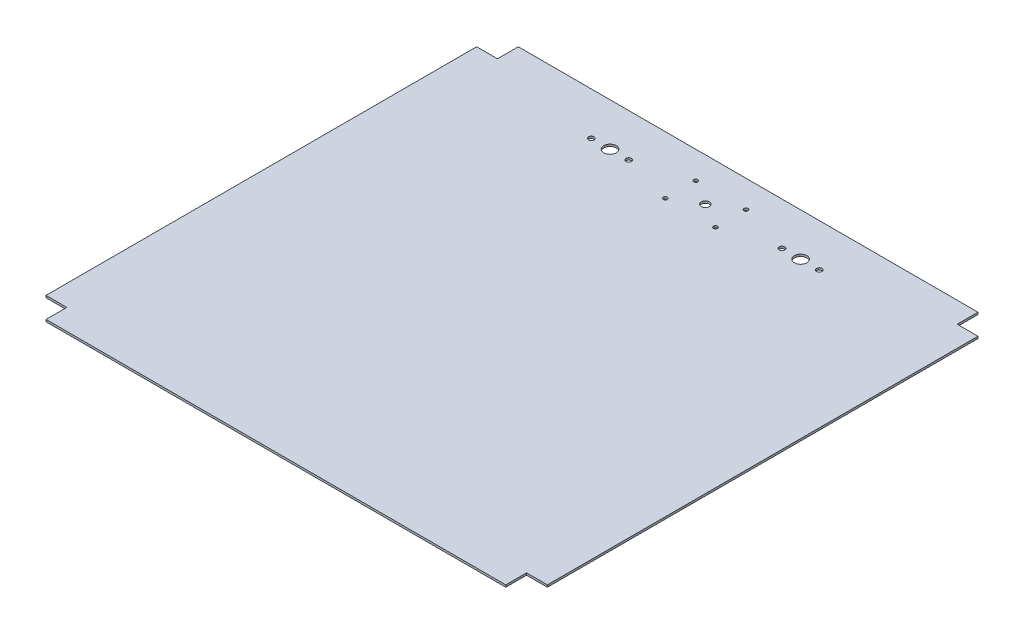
ISO-10303-21;
HEADER;
FILE_DESCRIPTION(('STEP AP214'),'2;1');
FILE_NAME('part.step','',(''),(''),'','','');
FILE_SCHEMA(('AUTOMOTIVE_DESIGN { 1 0 10303 214 1 1 1 1 }'));
ENDSEC;
DATA;
#1=APPLICATION_CONTEXT('core data for automotive mechanical design processes');
#2=APPLICATION_PROTOCOL_DEFINITION('international standard','automotive_design',2000,#1);
#3=PRODUCT_CONTEXT('',#1,'mechanical');
#4=PRODUCT('Part','Part','',(#3));
#5=PRODUCT_RELATED_PRODUCT_CATEGORY('part','',(#4));
#6=PRODUCT_DEFINITION_FORMATION('','',#4);
#7=PRODUCT_DEFINITION_CONTEXT('part definition',#1,'design');
#8=PRODUCT_DEFINITION('design','',#6,#7);
#9=PRODUCT_DEFINITION_SHAPE('','',#8);
#10=(LENGTH_UNIT() NAMED_UNIT(*) SI_UNIT(.MILLI.,.METRE.));
#11=(NAMED_UNIT(*) PLANE_ANGLE_UNIT() SI_UNIT($,.RADIAN.));
#12=(NAMED_UNIT(*) SI_UNIT($,.STERADIAN.) SOLID_ANGLE_UNIT());
#13=UNCERTAINTY_MEASURE_WITH_UNIT(LENGTH_MEASURE(1.E-05),#10,'distance_accuracy_value','');
#14=(GEOMETRIC_REPRESENTATION_CONTEXT(3) GLOBAL_UNCERTAINTY_ASSIGNED_CONTEXT((#13)) GLOBAL_UNIT_ASSIGNED_CONTEXT((#10,
#11,#12)) REPRESENTATION_CONTEXT('',''));
#15=CARTESIAN_POINT('',(0.,0.,0.));
#16=DIRECTION('',(0.,0.,1.));
#17=DIRECTION('',(1.,0.,0.));
#18=AXIS2_PLACEMENT_3D('',#15,#16,#17);
#19=CARTESIAN_POINT('',(241.,2.,-227.));
#20=DIRECTION('',(-1.,0.,0.));
#21=DIRECTION('',(0.,0.,1.));
#22=AXIS2_PLACEMENT_3D('',#19,#20,#21);
#23=PLANE('',#22);
#24=DIRECTION('',(0.,0.,-1.));
#25=VECTOR('',#24,1.);
#26=CARTESIAN_POINT('',(241.,2.,-227.));
#27=LINE('',#26,#25);
#28=CARTESIAN_POINT('',(241.,2.,207.));
#29=VERTEX_POINT('',#28);
#30=CARTESIAN_POINT('',(241.,2.,-207.));
#31=VERTEX_POINT('',#30);
#32=EDGE_CURVE('E175',#29,#31,#27,.T.);
#33=ORIENTED_EDGE('',*,*,#32,.F.);
#34=DIRECTION('',(0.,1.,0.));
#35=VECTOR('',#34,1.);
#36=CARTESIAN_POINT('',(241.,0.,207.));
#37=LINE('',#36,#35);
#38=CARTESIAN_POINT('',(241.,0.,207.));
#39=VERTEX_POINT('',#38);
#40=EDGE_CURVE('E224',#39,#29,#37,.T.);
#41=ORIENTED_EDGE('',*,*,#40,.F.);
#42=DIRECTION('',(0.,0.,-1.));
#43=VECTOR('',#42,1.);
#44=CARTESIAN_POINT('',(241.,0.,-227.));
#45=LINE('',#44,#43);
#46=CARTESIAN_POINT('',(241.,0.,-207.));
#47=VERTEX_POINT('',#46);
#48=EDGE_CURVE('E161',#39,#47,#45,.T.);
#49=ORIENTED_EDGE('',*,*,#48,.T.);
#50=DIRECTION('',(0.,1.,0.));
#51=VECTOR('',#50,1.);
#52=CARTESIAN_POINT('',(241.,0.,-207.));
#53=LINE('',#52,#51);
#54=EDGE_CURVE('E195',#47,#31,#53,.T.);
#55=ORIENTED_EDGE('',*,*,#54,.T.);
#56=EDGE_LOOP('',(#33,#41,#49,#55));
#57=FACE_BOUND('',#56,.T.);
#58=ADVANCED_FACE('F39',(#57),#23,.F.);
#59=CARTESIAN_POINT('',(-241.,2.,-227.));
#60=DIRECTION('',(0.,0.,1.));
#61=DIRECTION('',(1.,0.,0.));
#62=AXIS2_PLACEMENT_3D('',#59,#60,#61);
#63=PLANE('',#62);
#64=DIRECTION('',(-1.,0.,0.));
#65=VECTOR('',#64,1.);
#66=CARTESIAN_POINT('',(-241.,2.,-227.));
#67=LINE('',#66,#65);
#68=CARTESIAN_POINT('',(221.,2.,-227.));
#69=VERTEX_POINT('',#68);
#70=CARTESIAN_POINT('',(-221.,2.,-227.));
#71=VERTEX_POINT('',#70);
#72=EDGE_CURVE('E151',#69,#71,#67,.T.);
#73=ORIENTED_EDGE('',*,*,#72,.F.);
#74=DIRECTION('',(0.,1.,0.));
#75=VECTOR('',#74,1.);
#76=CARTESIAN_POINT('',(221.,0.,-227.));
#77=LINE('',#76,#75);
#78=CARTESIAN_POINT('',(221.,0.,-227.));
#79=VERTEX_POINT('',#78);
#80=EDGE_CURVE('E134',#79,#69,#77,.T.);
#81=ORIENTED_EDGE('',*,*,#80,.F.);
#82=DIRECTION('',(-1.,0.,0.));
#83=VECTOR('',#82,1.);
#84=CARTESIAN_POINT('',(-241.,0.,-227.));
#85=LINE('',#84,#83);
#86=CARTESIAN_POINT('',(-221.,0.,-227.));
#87=VERTEX_POINT('',#86);
#88=EDGE_CURVE('E149',#79,#87,#85,.T.);
#89=ORIENTED_EDGE('',*,*,#88,.T.);
#90=DIRECTION('',(0.,1.,0.));
#91=VECTOR('',#90,1.);
#92=CARTESIAN_POINT('',(-221.,0.,-227.));
#93=LINE('',#92,#91);
#94=EDGE_CURVE('E167',#87,#71,#93,.T.);
#95=ORIENTED_EDGE('',*,*,#94,.T.);
#96=EDGE_LOOP('',(#73,#81,#89,#95));
#97=FACE_BOUND('',#96,.T.);
#98=ADVANCED_FACE('F147',(#97),#63,.F.);
#99=CARTESIAN_POINT('',(-241.,2.,-227.));
#100=DIRECTION('',(1.,0.,0.));
#101=DIRECTION('',(0.,0.,-1.));
#102=AXIS2_PLACEMENT_3D('',#99,#100,#101);
#103=PLANE('',#102);
#104=DIRECTION('',(0.,0.,1.));
#105=VECTOR('',#104,1.);
#106=CARTESIAN_POINT('',(-241.,0.,-227.));
#107=LINE('',#106,#105);
#108=CARTESIAN_POINT('',(-241.,0.,-207.));
#109=VERTEX_POINT('',#108);
#110=CARTESIAN_POINT('',(-241.,0.,207.));
#111=VERTEX_POINT('',#110);
#112=EDGE_CURVE('E160',#109,#111,#107,.T.);
#113=ORIENTED_EDGE('',*,*,#112,.T.);
#114=DIRECTION('',(0.,1.,0.));
#115=VECTOR('',#114,1.);
#116=CARTESIAN_POINT('',(-241.,0.,207.));
#117=LINE('',#116,#115);
#118=CARTESIAN_POINT('',(-241.,2.,207.));
#119=VERTEX_POINT('',#118);
#120=EDGE_CURVE('E206',#111,#119,#117,.T.);
#121=ORIENTED_EDGE('',*,*,#120,.T.);
#122=DIRECTION('',(0.,0.,1.));
#123=VECTOR('',#122,1.);
#124=CARTESIAN_POINT('',(-241.,2.,-227.));
#125=LINE('',#124,#123);
#126=CARTESIAN_POINT('',(-241.,2.,-207.));
#127=VERTEX_POINT('',#126);
#128=EDGE_CURVE('E48',#127,#119,#125,.T.);
#129=ORIENTED_EDGE('',*,*,#128,.F.);
#130=DIRECTION('',(0.,1.,0.));
#131=VECTOR('',#130,1.);
#132=CARTESIAN_POINT('',(-241.,0.,-207.));
#133=LINE('',#132,#131);
#134=EDGE_CURVE('E179',#109,#127,#133,.T.);
#135=ORIENTED_EDGE('',*,*,#134,.F.);
#136=EDGE_LOOP('',(#113,#121,#129,#135));
#137=FACE_BOUND('',#136,.T.);
#138=ADVANCED_FACE('F373',(#137),#103,.F.);
#139=CARTESIAN_POINT('',(-241.,2.,227.));
#140=DIRECTION('',(0.,0.,-1.));
#141=DIRECTION('',(-1.,0.,0.));
#142=AXIS2_PLACEMENT_3D('',#139,#140,#141);
#143=PLANE('',#142);
#144=DIRECTION('',(1.,0.,0.));
#145=VECTOR('',#144,1.);
#146=CARTESIAN_POINT('',(-241.,2.,227.));
#147=LINE('',#146,#145);
#148=CARTESIAN_POINT('',(-221.,2.,227.));
#149=VERTEX_POINT('',#148);
#150=CARTESIAN_POINT('',(221.,2.,227.));
#151=VERTEX_POINT('',#150);
#152=EDGE_CURVE('E11',#149,#151,#147,.T.);
#153=ORIENTED_EDGE('',*,*,#152,.F.);
#154=DIRECTION('',(0.,1.,0.));
#155=VECTOR('',#154,1.);
#156=CARTESIAN_POINT('',(-221.,0.,227.));
#157=LINE('',#156,#155);
#158=CARTESIAN_POINT('',(-221.,0.,227.));
#159=VERTEX_POINT('',#158);
#160=EDGE_CURVE('E200',#159,#149,#157,.T.);
#161=ORIENTED_EDGE('',*,*,#160,.F.);
#162=DIRECTION('',(1.,0.,0.));
#163=VECTOR('',#162,1.);
#164=CARTESIAN_POINT('',(-241.,0.,227.));
#165=LINE('',#164,#163);
#166=CARTESIAN_POINT('',(221.,0.,227.));
#167=VERTEX_POINT('',#166);
#168=EDGE_CURVE('E42',#159,#167,#165,.T.);
#169=ORIENTED_EDGE('',*,*,#168,.T.);
#170=DIRECTION('',(0.,1.,0.));
#171=VECTOR('',#170,1.);
#172=CARTESIAN_POINT('',(221.,0.,227.));
#173=LINE('',#172,#171);
#174=EDGE_CURVE('E230',#167,#151,#173,.T.);
#175=ORIENTED_EDGE('',*,*,#174,.T.);
#176=EDGE_LOOP('',(#153,#161,#169,#175));
#177=FACE_BOUND('',#176,.T.);
#178=ADVANCED_FACE('F359',(#177),#143,.F.);
#179=CARTESIAN_POINT('',(0.,2.,0.));
#180=DIRECTION('',(0.,1.,0.));
#181=DIRECTION('',(0.,0.,1.));
#182=AXIS2_PLACEMENT_3D('',#179,#180,#181);
#183=PLANE('',#182);
#184=CARTESIAN_POINT('',(24.1,2.,-200.85));
#185=DIRECTION('',(0.,1.,0.));
#186=DIRECTION('',(0.,0.,1.));
#187=AXIS2_PLACEMENT_3D('',#184,#185,#186);
#188=CIRCLE('',#187,1.95);
#189=CARTESIAN_POINT('',(24.1,2.,-198.9));
#190=VERTEX_POINT('',#189);
#191=EDGE_CURVE('E307',#190,#190,#188,.T.);
#192=ORIENTED_EDGE('',*,*,#191,.F.);
#193=EDGE_LOOP('',(#192));
#194=FACE_BOUND('',#193,.T.);
#195=CARTESIAN_POINT('',(24.1,2.,-171.55));
#196=DIRECTION('',(0.,1.,0.));
#197=DIRECTION('',(0.,0.,1.));
#198=AXIS2_PLACEMENT_3D('',#195,#196,#197);
#199=CIRCLE('',#198,1.95);
#200=CARTESIAN_POINT('',(24.1,2.,-169.6));
#201=VERTEX_POINT('',#200);
#202=EDGE_CURVE('E298',#201,#201,#199,.T.);
#203=ORIENTED_EDGE('',*,*,#202,.F.);
#204=EDGE_LOOP('',(#203));
#205=FACE_BOUND('',#204,.T.);
#206=CARTESIAN_POINT('',(-109.55,2.,-185.85));
#207=DIRECTION('',(0.,1.,0.));
#208=DIRECTION('',(0.,0.,1.));
#209=AXIS2_PLACEMENT_3D('',#206,#207,#208);
#210=CIRCLE('',#209,2.65000000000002);
#211=CARTESIAN_POINT('',(-109.55,2.,-183.2));
#212=VERTEX_POINT('',#211);
#213=EDGE_CURVE('E323',#212,#212,#210,.T.);
#214=ORIENTED_EDGE('',*,*,#213,.F.);
#215=EDGE_LOOP('',(#214));
#216=FACE_BOUND('',#215,.T.);
#217=CARTESIAN_POINT('',(91.6,2.,-185.85));
#218=DIRECTION('',(0.,1.,0.));
#219=DIRECTION('',(0.,0.,-1.));
#220=AXIS2_PLACEMENT_3D('',#217,#218,#219);
#221=CIRCLE('',#220,6.);
#222=CARTESIAN_POINT('',(91.6,2.,-191.85));
#223=VERTEX_POINT('',#222);
#224=EDGE_CURVE('E314',#223,#223,#221,.T.);
#225=ORIENTED_EDGE('',*,*,#224,.F.);
#226=EDGE_LOOP('',(#225));
#227=FACE_BOUND('',#226,.T.);
#228=CARTESIAN_POINT('',(-73.65,2.,-185.85));
#229=DIRECTION('',(0.,1.,0.));
#230=DIRECTION('',(0.,0.,1.));
#231=AXIS2_PLACEMENT_3D('',#228,#229,#230);
#232=CIRCLE('',#231,2.65);
#233=CARTESIAN_POINT('',(-73.65,2.,-183.2));
#234=VERTEX_POINT('',#233);
#235=EDGE_CURVE('E275',#234,#234,#232,.T.);
#236=ORIENTED_EDGE('',*,*,#235,.F.);
#237=EDGE_LOOP('',(#236));
#238=FACE_BOUND('',#237,.T.);
#239=CARTESIAN_POINT('',(0.,2.,-185.85));
#240=DIRECTION('',(0.,1.,0.));
#241=DIRECTION('',(0.,0.,1.));
#242=AXIS2_PLACEMENT_3D('',#239,#240,#241);
#243=CIRCLE('',#242,3.89999999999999);
#244=CARTESIAN_POINT('',(0.,2.,-181.95));
#245=VERTEX_POINT('',#244);
#246=EDGE_CURVE('E266',#245,#245,#243,.T.);
#247=ORIENTED_EDGE('',*,*,#246,.F.);
#248=EDGE_LOOP('',(#247));
#249=FACE_BOUND('',#248,.T.);
#250=CARTESIAN_POINT('',(-24.1,2.,-200.85));
#251=DIRECTION('',(0.,1.,0.));
#252=DIRECTION('',(0.,0.,1.));
#253=AXIS2_PLACEMENT_3D('',#250,#251,#252);
#254=CIRCLE('',#253,1.95);
#255=CARTESIAN_POINT('',(-24.1,2.,-198.9));
#256=VERTEX_POINT('',#255);
#257=EDGE_CURVE('E291',#256,#256,#254,.T.);
#258=ORIENTED_EDGE('',*,*,#257,.F.);
#259=EDGE_LOOP('',(#258));
#260=FACE_BOUND('',#259,.T.);
#261=CARTESIAN_POINT('',(-24.1,2.,-171.55));
#262=DIRECTION('',(0.,1.,0.));
#263=DIRECTION('',(0.,0.,1.));
#264=AXIS2_PLACEMENT_3D('',#261,#262,#263);
#265=CIRCLE('',#264,1.95);
#266=CARTESIAN_POINT('',(-24.1,2.,-169.6));
#267=VERTEX_POINT('',#266);
#268=EDGE_CURVE('E282',#267,#267,#265,.T.);
#269=ORIENTED_EDGE('',*,*,#268,.F.);
#270=EDGE_LOOP('',(#269));
#271=FACE_BOUND('',#270,.T.);
#272=CARTESIAN_POINT('',(109.55,2.,-185.85));
#273=DIRECTION('',(0.,1.,0.));
#274=DIRECTION('',(0.,0.,-1.));
#275=AXIS2_PLACEMENT_3D('',#272,#273,#274);
#276=CIRCLE('',#275,2.65000000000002);
#277=CARTESIAN_POINT('',(109.55,2.,-188.5));
#278=VERTEX_POINT('',#277);
#279=EDGE_CURVE('E338',#278,#278,#276,.T.);
#280=ORIENTED_EDGE('',*,*,#279,.F.);
#281=EDGE_LOOP('',(#280));
#282=FACE_BOUND('',#281,.T.);
#283=CARTESIAN_POINT('',(73.65,2.,-185.85));
#284=DIRECTION('',(0.,1.,0.));
#285=DIRECTION('',(0.,0.,-1.));
#286=AXIS2_PLACEMENT_3D('',#283,#284,#285);
#287=CIRCLE('',#286,2.65);
#288=CARTESIAN_POINT('',(73.65,2.,-188.5));
#289=VERTEX_POINT('',#288);
#290=EDGE_CURVE('E330',#289,#289,#287,.T.);
#291=ORIENTED_EDGE('',*,*,#290,.F.);
#292=EDGE_LOOP('',(#291));
#293=FACE_BOUND('',#292,.T.);
#294=CARTESIAN_POINT('',(-91.6,2.,-185.85));
#295=DIRECTION('',(0.,1.,0.));
#296=DIRECTION('',(0.,0.,1.));
#297=AXIS2_PLACEMENT_3D('',#294,#295,#296);
#298=CIRCLE('',#297,6.);
#299=CARTESIAN_POINT('',(-91.6,2.,-179.85));
#300=VERTEX_POINT('',#299);
#301=EDGE_CURVE('E258',#300,#300,#298,.T.);
#302=ORIENTED_EDGE('',*,*,#301,.F.);
#303=EDGE_LOOP('',(#302));
#304=FACE_BOUND('',#303,.T.);
#305=DIRECTION('',(-1.,0.,0.));
#306=VECTOR('',#305,1.);
#307=CARTESIAN_POINT('',(-241.,2.,207.));
#308=LINE('',#307,#306);
#309=CARTESIAN_POINT('',(-221.,2.,207.));
#310=VERTEX_POINT('',#309);
#311=EDGE_CURVE('E211',#310,#119,#308,.T.);
#312=ORIENTED_EDGE('',*,*,#311,.F.);
#313=DIRECTION('',(0.,0.,-1.));
#314=VECTOR('',#313,1.);
#315=CARTESIAN_POINT('',(-221.,2.,227.));
#316=LINE('',#315,#314);
#317=EDGE_CURVE('E215',#149,#310,#316,.T.);
#318=ORIENTED_EDGE('',*,*,#317,.F.);
#319=ORIENTED_EDGE('',*,*,#152,.T.);
#320=DIRECTION('',(0.,0.,1.));
#321=VECTOR('',#320,1.);
#322=CARTESIAN_POINT('',(221.,2.,227.));
#323=LINE('',#322,#321);
#324=CARTESIAN_POINT('',(221.,2.,207.));
#325=VERTEX_POINT('',#324);
#326=EDGE_CURVE('E235',#325,#151,#323,.T.);
#327=ORIENTED_EDGE('',*,*,#326,.F.);
#328=DIRECTION('',(-1.,0.,0.));
#329=VECTOR('',#328,1.);
#330=CARTESIAN_POINT('',(241.,2.,207.));
#331=LINE('',#330,#329);
#332=EDGE_CURVE('E210',#29,#325,#331,.T.);
#333=ORIENTED_EDGE('',*,*,#332,.F.);
#334=ORIENTED_EDGE('',*,*,#32,.T.);
#335=DIRECTION('',(1.,0.,0.));
#336=VECTOR('',#335,1.);
#337=CARTESIAN_POINT('',(241.,2.,-207.));
#338=LINE('',#337,#336);
#339=CARTESIAN_POINT('',(221.,2.,-207.));
#340=VERTEX_POINT('',#339);
#341=EDGE_CURVE('E142',#340,#31,#338,.T.);
#342=ORIENTED_EDGE('',*,*,#341,.F.);
#343=DIRECTION('',(0.,0.,1.));
#344=VECTOR('',#343,1.);
#345=CARTESIAN_POINT('',(221.,2.,-227.));
#346=LINE('',#345,#344);
#347=EDGE_CURVE('E234',#69,#340,#346,.T.);
#348=ORIENTED_EDGE('',*,*,#347,.F.);
#349=ORIENTED_EDGE('',*,*,#72,.T.);
#350=DIRECTION('',(0.,0.,-1.));
#351=VECTOR('',#350,1.);
#352=CARTESIAN_POINT('',(-221.,2.,-227.));
#353=LINE('',#352,#351);
#354=CARTESIAN_POINT('',(-221.,2.,-207.));
#355=VERTEX_POINT('',#354);
#356=EDGE_CURVE('E187',#355,#71,#353,.T.);
#357=ORIENTED_EDGE('',*,*,#356,.F.);
#358=DIRECTION('',(1.,0.,0.));
#359=VECTOR('',#358,1.);
#360=CARTESIAN_POINT('',(-241.,2.,-207.));
#361=LINE('',#360,#359);
#362=EDGE_CURVE('E191',#127,#355,#361,.T.);
#363=ORIENTED_EDGE('',*,*,#362,.F.);
#364=ORIENTED_EDGE('',*,*,#128,.T.);
#365=EDGE_LOOP('',(#312,#318,#319,#327,#333,#334,#342,#348,#349,#357,#363,#364));
#366=FACE_BOUND('',#365,.T.);
#367=ADVANCED_FACE('F356',(#194,#205,#216,#227,#238,#249,#260,#271,#282,#293,#304,#366),#183,.T.);
#368=CARTESIAN_POINT('',(0.,0.,0.));
#369=DIRECTION('',(0.,1.,0.));
#370=DIRECTION('',(0.,0.,1.));
#371=AXIS2_PLACEMENT_3D('',#368,#369,#370);
#372=PLANE('',#371);
#373=CARTESIAN_POINT('',(24.1,0.,-200.85));
#374=DIRECTION('',(0.,1.,0.));
#375=DIRECTION('',(0.,0.,1.));
#376=AXIS2_PLACEMENT_3D('',#373,#374,#375);
#377=CIRCLE('',#376,1.95);
#378=CARTESIAN_POINT('',(24.1,0.,-198.9));
#379=VERTEX_POINT('',#378);
#380=EDGE_CURVE('E287',#379,#379,#377,.T.);
#381=ORIENTED_EDGE('',*,*,#380,.T.);
#382=EDGE_LOOP('',(#381));
#383=FACE_BOUND('',#382,.T.);
#384=CARTESIAN_POINT('',(24.1,0.,-171.55));
#385=DIRECTION('',(0.,1.,0.));
#386=DIRECTION('',(0.,0.,1.));
#387=AXIS2_PLACEMENT_3D('',#384,#385,#386);
#388=CIRCLE('',#387,1.95);
#389=CARTESIAN_POINT('',(24.1,0.,-169.6));
#390=VERTEX_POINT('',#389);
#391=EDGE_CURVE('E302',#390,#390,#388,.T.);
#392=ORIENTED_EDGE('',*,*,#391,.T.);
#393=EDGE_LOOP('',(#392));
#394=FACE_BOUND('',#393,.T.);
#395=CARTESIAN_POINT('',(-109.55,0.,-185.85));
#396=DIRECTION('',(0.,1.,0.));
#397=DIRECTION('',(0.,0.,1.));
#398=AXIS2_PLACEMENT_3D('',#395,#396,#397);
#399=CIRCLE('',#398,2.65000000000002);
#400=CARTESIAN_POINT('',(-109.55,0.,-183.2));
#401=VERTEX_POINT('',#400);
#402=EDGE_CURVE('E303',#401,#401,#399,.T.);
#403=ORIENTED_EDGE('',*,*,#402,.T.);
#404=EDGE_LOOP('',(#403));
#405=FACE_BOUND('',#404,.T.);
#406=CARTESIAN_POINT('',(91.6,0.,-185.85));
#407=DIRECTION('',(0.,1.,0.));
#408=DIRECTION('',(0.,0.,-1.));
#409=AXIS2_PLACEMENT_3D('',#406,#407,#408);
#410=CIRCLE('',#409,6.);
#411=CARTESIAN_POINT('',(91.6,0.,-191.85));
#412=VERTEX_POINT('',#411);
#413=EDGE_CURVE('E318',#412,#412,#410,.T.);
#414=ORIENTED_EDGE('',*,*,#413,.T.);
#415=EDGE_LOOP('',(#414));
#416=FACE_BOUND('',#415,.T.);
#417=CARTESIAN_POINT('',(-73.65,0.,-185.85));
#418=DIRECTION('',(0.,1.,0.));
#419=DIRECTION('',(0.,0.,1.));
#420=AXIS2_PLACEMENT_3D('',#417,#418,#419);
#421=CIRCLE('',#420,2.65);
#422=CARTESIAN_POINT('',(-73.65,0.,-183.2));
#423=VERTEX_POINT('',#422);
#424=EDGE_CURVE('E262',#423,#423,#421,.T.);
#425=ORIENTED_EDGE('',*,*,#424,.T.);
#426=EDGE_LOOP('',(#425));
#427=FACE_BOUND('',#426,.T.);
#428=CARTESIAN_POINT('',(0.,0.,-185.85));
#429=DIRECTION('',(0.,1.,0.));
#430=DIRECTION('',(0.,0.,1.));
#431=AXIS2_PLACEMENT_3D('',#428,#429,#430);
#432=CIRCLE('',#431,3.89999999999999);
#433=CARTESIAN_POINT('',(0.,0.,-181.95));
#434=VERTEX_POINT('',#433);
#435=EDGE_CURVE('E270',#434,#434,#432,.T.);
#436=ORIENTED_EDGE('',*,*,#435,.T.);
#437=EDGE_LOOP('',(#436));
#438=FACE_BOUND('',#437,.T.);
#439=CARTESIAN_POINT('',(-24.1,0.,-200.85));
#440=DIRECTION('',(0.,1.,0.));
#441=DIRECTION('',(0.,0.,1.));
#442=AXIS2_PLACEMENT_3D('',#439,#440,#441);
#443=CIRCLE('',#442,1.95);
#444=CARTESIAN_POINT('',(-24.1,0.,-198.9));
#445=VERTEX_POINT('',#444);
#446=EDGE_CURVE('E271',#445,#445,#443,.T.);
#447=ORIENTED_EDGE('',*,*,#446,.T.);
#448=EDGE_LOOP('',(#447));
#449=FACE_BOUND('',#448,.T.);
#450=CARTESIAN_POINT('',(-24.1,0.,-171.55));
#451=DIRECTION('',(0.,1.,0.));
#452=DIRECTION('',(0.,0.,1.));
#453=AXIS2_PLACEMENT_3D('',#450,#451,#452);
#454=CIRCLE('',#453,1.95);
#455=CARTESIAN_POINT('',(-24.1,0.,-169.6));
#456=VERTEX_POINT('',#455);
#457=EDGE_CURVE('E286',#456,#456,#454,.T.);
#458=ORIENTED_EDGE('',*,*,#457,.T.);
#459=EDGE_LOOP('',(#458));
#460=FACE_BOUND('',#459,.T.);
#461=CARTESIAN_POINT('',(109.55,0.,-185.85));
#462=DIRECTION('',(0.,1.,0.));
#463=DIRECTION('',(0.,0.,-1.));
#464=AXIS2_PLACEMENT_3D('',#461,#462,#463);
#465=CIRCLE('',#464,2.65000000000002);
#466=CARTESIAN_POINT('',(109.55,0.,-188.5));
#467=VERTEX_POINT('',#466);
#468=EDGE_CURVE('E319',#467,#467,#465,.T.);
#469=ORIENTED_EDGE('',*,*,#468,.T.);
#470=EDGE_LOOP('',(#469));
#471=FACE_BOUND('',#470,.T.);
#472=CARTESIAN_POINT('',(73.65,0.,-185.85));
#473=DIRECTION('',(0.,1.,0.));
#474=DIRECTION('',(0.,0.,-1.));
#475=AXIS2_PLACEMENT_3D('',#472,#473,#474);
#476=CIRCLE('',#475,2.65);
#477=CARTESIAN_POINT('',(73.65,0.,-188.5));
#478=VERTEX_POINT('',#477);
#479=EDGE_CURVE('E334',#478,#478,#476,.T.);
#480=ORIENTED_EDGE('',*,*,#479,.T.);
#481=EDGE_LOOP('',(#480));
#482=FACE_BOUND('',#481,.T.);
#483=CARTESIAN_POINT('',(-91.6,0.,-185.85));
#484=DIRECTION('',(0.,1.,0.));
#485=DIRECTION('',(0.,0.,1.));
#486=AXIS2_PLACEMENT_3D('',#483,#484,#485);
#487=CIRCLE('',#486,6.);
#488=CARTESIAN_POINT('',(-91.6,0.,-179.85));
#489=VERTEX_POINT('',#488);
#490=EDGE_CURVE('E219',#489,#489,#487,.T.);
#491=ORIENTED_EDGE('',*,*,#490,.T.);
#492=EDGE_LOOP('',(#491));
#493=FACE_BOUND('',#492,.T.);
#494=DIRECTION('',(0.,0.,-1.));
#495=VECTOR('',#494,1.);
#496=CARTESIAN_POINT('',(-221.,0.,227.));
#497=LINE('',#496,#495);
#498=CARTESIAN_POINT('',(-221.,0.,207.));
#499=VERTEX_POINT('',#498);
#500=EDGE_CURVE('E214',#159,#499,#497,.T.);
#501=ORIENTED_EDGE('',*,*,#500,.T.);
#502=DIRECTION('',(-1.,0.,0.));
#503=VECTOR('',#502,1.);
#504=CARTESIAN_POINT('',(-241.,0.,207.));
#505=LINE('',#504,#503);
#506=EDGE_CURVE('E56',#499,#111,#505,.T.);
#507=ORIENTED_EDGE('',*,*,#506,.T.);
#508=ORIENTED_EDGE('',*,*,#112,.F.);
#509=DIRECTION('',(1.,0.,0.));
#510=VECTOR('',#509,1.);
#511=CARTESIAN_POINT('',(-241.,0.,-207.));
#512=LINE('',#511,#510);
#513=CARTESIAN_POINT('',(-221.,0.,-207.));
#514=VERTEX_POINT('',#513);
#515=EDGE_CURVE('E190',#109,#514,#512,.T.);
#516=ORIENTED_EDGE('',*,*,#515,.T.);
#517=DIRECTION('',(0.,0.,-1.));
#518=VECTOR('',#517,1.);
#519=CARTESIAN_POINT('',(-221.,0.,-227.));
#520=LINE('',#519,#518);
#521=EDGE_CURVE('E158',#514,#87,#520,.T.);
#522=ORIENTED_EDGE('',*,*,#521,.T.);
#523=ORIENTED_EDGE('',*,*,#88,.F.);
#524=DIRECTION('',(0.,0.,1.));
#525=VECTOR('',#524,1.);
#526=CARTESIAN_POINT('',(221.,0.,-227.));
#527=LINE('',#526,#525);
#528=CARTESIAN_POINT('',(221.,0.,-207.));
#529=VERTEX_POINT('',#528);
#530=EDGE_CURVE('E130',#79,#529,#527,.T.);
#531=ORIENTED_EDGE('',*,*,#530,.T.);
#532=DIRECTION('',(1.,0.,0.));
#533=VECTOR('',#532,1.);
#534=CARTESIAN_POINT('',(241.,0.,-207.));
#535=LINE('',#534,#533);
#536=EDGE_CURVE('E141',#529,#47,#535,.T.);
#537=ORIENTED_EDGE('',*,*,#536,.T.);
#538=ORIENTED_EDGE('',*,*,#48,.F.);
#539=DIRECTION('',(-1.,0.,0.));
#540=VECTOR('',#539,1.);
#541=CARTESIAN_POINT('',(241.,0.,207.));
#542=LINE('',#541,#540);
#543=CARTESIAN_POINT('',(221.,0.,207.));
#544=VERTEX_POINT('',#543);
#545=EDGE_CURVE('E238',#39,#544,#542,.T.);
#546=ORIENTED_EDGE('',*,*,#545,.T.);
#547=DIRECTION('',(0.,0.,1.));
#548=VECTOR('',#547,1.);
#549=CARTESIAN_POINT('',(221.,0.,227.));
#550=LINE('',#549,#548);
#551=EDGE_CURVE('E64',#544,#167,#550,.T.);
#552=ORIENTED_EDGE('',*,*,#551,.T.);
#553=ORIENTED_EDGE('',*,*,#168,.F.);
#554=EDGE_LOOP('',(#501,#507,#508,#516,#522,#523,#531,#537,#538,#546,#552,#553));
#555=FACE_BOUND('',#554,.T.);
#556=ADVANCED_FACE('F156',(#383,#394,#405,#416,#427,#438,#449,#460,#471,#482,#493,#555),#372,.F.);
#557=CARTESIAN_POINT('',(-221.,0.,-227.));
#558=DIRECTION('',(1.,0.,0.));
#559=DIRECTION('',(0.,0.,-1.));
#560=AXIS2_PLACEMENT_3D('',#557,#558,#559);
#561=PLANE('',#560);
#562=ORIENTED_EDGE('',*,*,#356,.T.);
#563=ORIENTED_EDGE('',*,*,#94,.F.);
#564=ORIENTED_EDGE('',*,*,#521,.F.);
#565=DIRECTION('',(0.,1.,0.));
#566=VECTOR('',#565,1.);
#567=CARTESIAN_POINT('',(-221.,0.,-207.));
#568=LINE('',#567,#566);
#569=EDGE_CURVE('E182',#514,#355,#568,.T.);
#570=ORIENTED_EDGE('',*,*,#569,.T.);
#571=EDGE_LOOP('',(#562,#563,#564,#570));
#572=FACE_BOUND('',#571,.T.);
#573=ADVANCED_FACE('F396',(#572),#561,.F.);
#574=CARTESIAN_POINT('',(-241.,0.,-207.));
#575=DIRECTION('',(0.,0.,1.));
#576=DIRECTION('',(1.,0.,0.));
#577=AXIS2_PLACEMENT_3D('',#574,#575,#576);
#578=PLANE('',#577);
#579=ORIENTED_EDGE('',*,*,#362,.T.);
#580=ORIENTED_EDGE('',*,*,#569,.F.);
#581=ORIENTED_EDGE('',*,*,#515,.F.);
#582=ORIENTED_EDGE('',*,*,#134,.T.);
#583=EDGE_LOOP('',(#579,#580,#581,#582));
#584=FACE_BOUND('',#583,.T.);
#585=ADVANCED_FACE('F399',(#584),#578,.F.);
#586=CARTESIAN_POINT('',(241.,0.,-207.));
#587=DIRECTION('',(0.,0.,1.));
#588=DIRECTION('',(1.,0.,0.));
#589=AXIS2_PLACEMENT_3D('',#586,#587,#588);
#590=PLANE('',#589);
#591=ORIENTED_EDGE('',*,*,#341,.T.);
#592=ORIENTED_EDGE('',*,*,#54,.F.);
#593=ORIENTED_EDGE('',*,*,#536,.F.);
#594=DIRECTION('',(0.,1.,0.));
#595=VECTOR('',#594,1.);
#596=CARTESIAN_POINT('',(221.,0.,-207.));
#597=LINE('',#596,#595);
#598=EDGE_CURVE('E136',#529,#340,#597,.T.);
#599=ORIENTED_EDGE('',*,*,#598,.T.);
#600=EDGE_LOOP('',(#591,#592,#593,#599));
#601=FACE_BOUND('',#600,.T.);
#602=ADVANCED_FACE('F392',(#601),#590,.F.);
#603=CARTESIAN_POINT('',(221.,0.,-227.));
#604=DIRECTION('',(-1.,0.,0.));
#605=DIRECTION('',(0.,0.,1.));
#606=AXIS2_PLACEMENT_3D('',#603,#604,#605);
#607=PLANE('',#606);
#608=ORIENTED_EDGE('',*,*,#347,.T.);
#609=ORIENTED_EDGE('',*,*,#598,.F.);
#610=ORIENTED_EDGE('',*,*,#530,.F.);
#611=ORIENTED_EDGE('',*,*,#80,.T.);
#612=EDGE_LOOP('',(#608,#609,#610,#611));
#613=FACE_BOUND('',#612,.T.);
#614=ADVANCED_FACE('F133',(#613),#607,.F.);
#615=CARTESIAN_POINT('',(221.,0.,227.));
#616=DIRECTION('',(-1.,0.,0.));
#617=DIRECTION('',(0.,0.,1.));
#618=AXIS2_PLACEMENT_3D('',#615,#616,#617);
#619=PLANE('',#618);
#620=ORIENTED_EDGE('',*,*,#326,.T.);
#621=ORIENTED_EDGE('',*,*,#174,.F.);
#622=ORIENTED_EDGE('',*,*,#551,.F.);
#623=DIRECTION('',(0.,1.,0.));
#624=VECTOR('',#623,1.);
#625=CARTESIAN_POINT('',(221.,0.,207.));
#626=LINE('',#625,#624);
#627=EDGE_CURVE('E227',#544,#325,#626,.T.);
#628=ORIENTED_EDGE('',*,*,#627,.T.);
#629=EDGE_LOOP('',(#620,#621,#622,#628));
#630=FACE_BOUND('',#629,.T.);
#631=ADVANCED_FACE('F385',(#630),#619,.F.);
#632=CARTESIAN_POINT('',(241.,0.,207.));
#633=DIRECTION('',(0.,0.,-1.));
#634=DIRECTION('',(-1.,0.,0.));
#635=AXIS2_PLACEMENT_3D('',#632,#633,#634);
#636=PLANE('',#635);
#637=ORIENTED_EDGE('',*,*,#332,.T.);
#638=ORIENTED_EDGE('',*,*,#627,.F.);
#639=ORIENTED_EDGE('',*,*,#545,.F.);
#640=ORIENTED_EDGE('',*,*,#40,.T.);
#641=EDGE_LOOP('',(#637,#638,#639,#640));
#642=FACE_BOUND('',#641,.T.);
#643=ADVANCED_FACE('F387',(#642),#636,.F.);
#644=CARTESIAN_POINT('',(-241.,0.,207.));
#645=DIRECTION('',(0.,0.,-1.));
#646=DIRECTION('',(-1.,0.,0.));
#647=AXIS2_PLACEMENT_3D('',#644,#645,#646);
#648=PLANE('',#647);
#649=ORIENTED_EDGE('',*,*,#311,.T.);
#650=ORIENTED_EDGE('',*,*,#120,.F.);
#651=ORIENTED_EDGE('',*,*,#506,.F.);
#652=DIRECTION('',(0.,1.,0.));
#653=VECTOR('',#652,1.);
#654=CARTESIAN_POINT('',(-221.,0.,207.));
#655=LINE('',#654,#653);
#656=EDGE_CURVE('E203',#499,#310,#655,.T.);
#657=ORIENTED_EDGE('',*,*,#656,.T.);
#658=EDGE_LOOP('',(#649,#650,#651,#657));
#659=FACE_BOUND('',#658,.T.);
#660=ADVANCED_FACE('F371',(#659),#648,.F.);
#661=CARTESIAN_POINT('',(-221.,0.,227.));
#662=DIRECTION('',(1.,0.,0.));
#663=DIRECTION('',(0.,0.,-1.));
#664=AXIS2_PLACEMENT_3D('',#661,#662,#663);
#665=PLANE('',#664);
#666=ORIENTED_EDGE('',*,*,#317,.T.);
#667=ORIENTED_EDGE('',*,*,#656,.F.);
#668=ORIENTED_EDGE('',*,*,#500,.F.);
#669=ORIENTED_EDGE('',*,*,#160,.T.);
#670=EDGE_LOOP('',(#666,#667,#668,#669));
#671=FACE_BOUND('',#670,.T.);
#672=ADVANCED_FACE('F380',(#671),#665,.F.);
#673=CARTESIAN_POINT('',(-91.6,0.,-185.85));
#674=DIRECTION('',(0.,1.,0.));
#675=DIRECTION('',(0.,0.,1.));
#676=AXIS2_PLACEMENT_3D('',#673,#674,#675);
#677=CYLINDRICAL_SURFACE('',#676,6.);
#678=ORIENTED_EDGE('',*,*,#490,.F.);
#679=EDGE_LOOP('',(#678));
#680=FACE_BOUND('',#679,.T.);
#681=ORIENTED_EDGE('',*,*,#301,.T.);
#682=EDGE_LOOP('',(#681));
#683=FACE_BOUND('',#682,.T.);
#684=ADVANCED_FACE('F461',(#680,#683),#677,.F.);
#685=CARTESIAN_POINT('',(73.65,0.,-185.85));
#686=DIRECTION('',(0.,1.,0.));
#687=DIRECTION('',(0.,0.,1.));
#688=AXIS2_PLACEMENT_3D('',#685,#686,#687);
#689=CYLINDRICAL_SURFACE('',#688,2.65);
#690=ORIENTED_EDGE('',*,*,#479,.F.);
#691=EDGE_LOOP('',(#690));
#692=FACE_BOUND('',#691,.T.);
#693=ORIENTED_EDGE('',*,*,#290,.T.);
#694=EDGE_LOOP('',(#693));
#695=FACE_BOUND('',#694,.T.);
#696=ADVANCED_FACE('F352',(#692,#695),#689,.F.);
#697=CARTESIAN_POINT('',(109.55,0.,-185.85));
#698=DIRECTION('',(0.,1.,0.));
#699=DIRECTION('',(0.,0.,1.));
#700=AXIS2_PLACEMENT_3D('',#697,#698,#699);
#701=CYLINDRICAL_SURFACE('',#700,2.65000000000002);
#702=ORIENTED_EDGE('',*,*,#468,.F.);
#703=EDGE_LOOP('',(#702));
#704=FACE_BOUND('',#703,.T.);
#705=ORIENTED_EDGE('',*,*,#279,.T.);
#706=EDGE_LOOP('',(#705));
#707=FACE_BOUND('',#706,.T.);
#708=ADVANCED_FACE('F348',(#704,#707),#701,.F.);
#709=CARTESIAN_POINT('',(-24.1,0.,-171.55));
#710=DIRECTION('',(0.,1.,0.));
#711=DIRECTION('',(0.,0.,1.));
#712=AXIS2_PLACEMENT_3D('',#709,#710,#711);
#713=CYLINDRICAL_SURFACE('',#712,1.95);
#714=ORIENTED_EDGE('',*,*,#457,.F.);
#715=EDGE_LOOP('',(#714));
#716=FACE_BOUND('',#715,.T.);
#717=ORIENTED_EDGE('',*,*,#268,.T.);
#718=EDGE_LOOP('',(#717));
#719=FACE_BOUND('',#718,.T.);
#720=ADVANCED_FACE('F351',(#716,#719),#713,.F.);
#721=CARTESIAN_POINT('',(-24.1,0.,-200.85));
#722=DIRECTION('',(0.,1.,0.));
#723=DIRECTION('',(0.,0.,1.));
#724=AXIS2_PLACEMENT_3D('',#721,#722,#723);
#725=CYLINDRICAL_SURFACE('',#724,1.95);
#726=ORIENTED_EDGE('',*,*,#446,.F.);
#727=EDGE_LOOP('',(#726));
#728=FACE_BOUND('',#727,.T.);
#729=ORIENTED_EDGE('',*,*,#257,.T.);
#730=EDGE_LOOP('',(#729));
#731=FACE_BOUND('',#730,.T.);
#732=ADVANCED_FACE('F441',(#728,#731),#725,.F.);
#733=CARTESIAN_POINT('',(0.,0.,-185.85));
#734=DIRECTION('',(0.,1.,0.));
#735=DIRECTION('',(0.,0.,1.));
#736=AXIS2_PLACEMENT_3D('',#733,#734,#735);
#737=CYLINDRICAL_SURFACE('',#736,3.89999999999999);
#738=ORIENTED_EDGE('',*,*,#435,.F.);
#739=EDGE_LOOP('',(#738));
#740=FACE_BOUND('',#739,.T.);
#741=ORIENTED_EDGE('',*,*,#246,.T.);
#742=EDGE_LOOP('',(#741));
#743=FACE_BOUND('',#742,.T.);
#744=ADVANCED_FACE('F448',(#740,#743),#737,.F.);
#745=CARTESIAN_POINT('',(-73.65,0.,-185.85));
#746=DIRECTION('',(0.,1.,0.));
#747=DIRECTION('',(0.,0.,1.));
#748=AXIS2_PLACEMENT_3D('',#745,#746,#747);
#749=CYLINDRICAL_SURFACE('',#748,2.65);
#750=ORIENTED_EDGE('',*,*,#424,.F.);
#751=EDGE_LOOP('',(#750));
#752=FACE_BOUND('',#751,.T.);
#753=ORIENTED_EDGE('',*,*,#235,.T.);
#754=EDGE_LOOP('',(#753));
#755=FACE_BOUND('',#754,.T.);
#756=ADVANCED_FACE('F453',(#752,#755),#749,.F.);
#757=CARTESIAN_POINT('',(91.6,0.,-185.85));
#758=DIRECTION('',(0.,1.,0.));
#759=DIRECTION('',(0.,0.,1.));
#760=AXIS2_PLACEMENT_3D('',#757,#758,#759);
#761=CYLINDRICAL_SURFACE('',#760,6.);
#762=ORIENTED_EDGE('',*,*,#413,.F.);
#763=EDGE_LOOP('',(#762));
#764=FACE_BOUND('',#763,.T.);
#765=ORIENTED_EDGE('',*,*,#224,.T.);
#766=EDGE_LOOP('',(#765));
#767=FACE_BOUND('',#766,.T.);
#768=ADVANCED_FACE('F456',(#764,#767),#761,.F.);
#769=CARTESIAN_POINT('',(-109.55,0.,-185.85));
#770=DIRECTION('',(0.,1.,0.));
#771=DIRECTION('',(0.,0.,1.));
#772=AXIS2_PLACEMENT_3D('',#769,#770,#771);
#773=CYLINDRICAL_SURFACE('',#772,2.65000000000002);
#774=ORIENTED_EDGE('',*,*,#402,.F.);
#775=EDGE_LOOP('',(#774));
#776=FACE_BOUND('',#775,.T.);
#777=ORIENTED_EDGE('',*,*,#213,.T.);
#778=EDGE_LOOP('',(#777));
#779=FACE_BOUND('',#778,.T.);
#780=ADVANCED_FACE('F525',(#776,#779),#773,.F.);
#781=CARTESIAN_POINT('',(24.1,0.,-171.55));
#782=DIRECTION('',(0.,1.,0.));
#783=DIRECTION('',(0.,0.,1.));
#784=AXIS2_PLACEMENT_3D('',#781,#782,#783);
#785=CYLINDRICAL_SURFACE('',#784,1.95);
#786=ORIENTED_EDGE('',*,*,#391,.F.);
#787=EDGE_LOOP('',(#786));
#788=FACE_BOUND('',#787,.T.);
#789=ORIENTED_EDGE('',*,*,#202,.T.);
#790=EDGE_LOOP('',(#789));
#791=FACE_BOUND('',#790,.T.);
#792=ADVANCED_FACE('F535',(#788,#791),#785,.F.);
#793=CARTESIAN_POINT('',(24.1,0.,-200.85));
#794=DIRECTION('',(0.,1.,0.));
#795=DIRECTION('',(0.,0.,1.));
#796=AXIS2_PLACEMENT_3D('',#793,#794,#795);
#797=CYLINDRICAL_SURFACE('',#796,1.95);
#798=ORIENTED_EDGE('',*,*,#380,.F.);
#799=EDGE_LOOP('',(#798));
#800=FACE_BOUND('',#799,.T.);
#801=ORIENTED_EDGE('',*,*,#191,.T.);
#802=EDGE_LOOP('',(#801));
#803=FACE_BOUND('',#802,.T.);
#804=ADVANCED_FACE('F545',(#800,#803),#797,.F.);
#805=CLOSED_SHELL('',(#58,#98,#138,#178,#367,#556,#573,#585,#602,#614,#631,#643,#660,#672,#684,
#696,#708,#720,#732,#744,#756,#768,#780,#792,#804));
#806=MANIFOLD_SOLID_BREP('B2',#805);
#807=ADVANCED_BREP_SHAPE_REPRESENTATION('',(#18,#806),#14);
#808=SHAPE_DEFINITION_REPRESENTATION(#9,#807);
ENDSEC;
END-ISO-10303-21;
